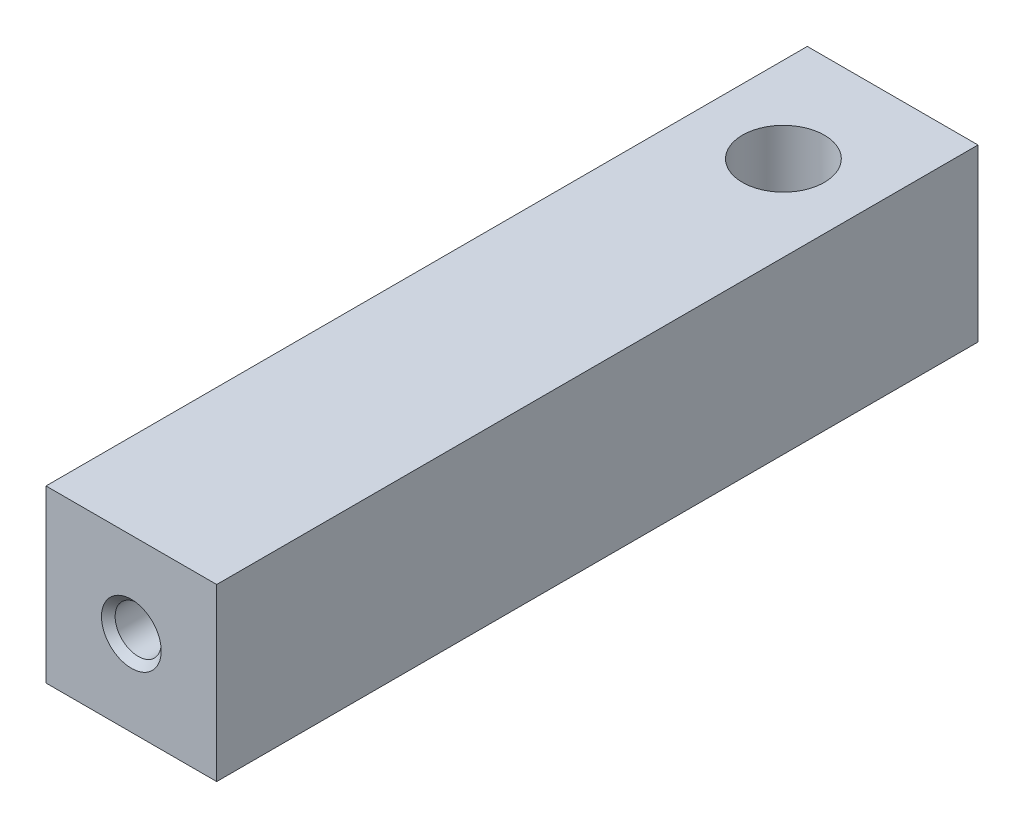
ISO-10303-21;
HEADER;
FILE_DESCRIPTION(('STEP AP214'),'2;1');
FILE_NAME('part.step','',(''),(''),'','','');
FILE_SCHEMA(('AUTOMOTIVE_DESIGN { 1 0 10303 214 1 1 1 1 }'));
ENDSEC;
DATA;
#1=APPLICATION_CONTEXT('core data for automotive mechanical design processes');
#2=APPLICATION_PROTOCOL_DEFINITION('international standard','automotive_design',2000,#1);
#3=PRODUCT_CONTEXT('',#1,'mechanical');
#4=PRODUCT('Part','Part','',(#3));
#5=PRODUCT_RELATED_PRODUCT_CATEGORY('part','',(#4));
#6=PRODUCT_DEFINITION_FORMATION('','',#4);
#7=PRODUCT_DEFINITION_CONTEXT('part definition',#1,'design');
#8=PRODUCT_DEFINITION('design','',#6,#7);
#9=PRODUCT_DEFINITION_SHAPE('','',#8);
#10=(LENGTH_UNIT() NAMED_UNIT(*) SI_UNIT(.MILLI.,.METRE.));
#11=(NAMED_UNIT(*) PLANE_ANGLE_UNIT() SI_UNIT($,.RADIAN.));
#12=(NAMED_UNIT(*) SI_UNIT($,.STERADIAN.) SOLID_ANGLE_UNIT());
#13=UNCERTAINTY_MEASURE_WITH_UNIT(LENGTH_MEASURE(1.E-05),#10,'distance_accuracy_value','');
#14=(GEOMETRIC_REPRESENTATION_CONTEXT(3) GLOBAL_UNCERTAINTY_ASSIGNED_CONTEXT((#13)) GLOBAL_UNIT_ASSIGNED_CONTEXT((#10,
#11,#12)) REPRESENTATION_CONTEXT('',''));
#15=CARTESIAN_POINT('',(0.,0.,0.));
#16=DIRECTION('',(0.,0.,1.));
#17=DIRECTION('',(1.,0.,0.));
#18=AXIS2_PLACEMENT_3D('',#15,#16,#17);
#19=CARTESIAN_POINT('',(-12.5,12.5000000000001,111.5));
#20=DIRECTION('',(1.,0.,0.));
#21=DIRECTION('',(0.,1.,0.));
#22=AXIS2_PLACEMENT_3D('',#19,#20,#21);
#23=PLANE('',#22);
#24=DIRECTION('',(0.,-1.,0.));
#25=VECTOR('',#24,1.);
#26=CARTESIAN_POINT('',(-12.5,12.4999999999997,0.));
#27=LINE('',#26,#25);
#28=CARTESIAN_POINT('',(-12.5,12.4999999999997,0.));
#29=VERTEX_POINT('',#28);
#30=CARTESIAN_POINT('',(-12.5,-12.5000000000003,0.));
#31=VERTEX_POINT('',#30);
#32=EDGE_CURVE('E123',#29,#31,#27,.T.);
#33=ORIENTED_EDGE('',*,*,#32,.T.);
#34=DIRECTION('',(0.,0.,-1.));
#35=VECTOR('',#34,1.);
#36=CARTESIAN_POINT('',(-12.5,-12.4999999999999,111.5));
#37=LINE('',#36,#35);
#38=CARTESIAN_POINT('',(-12.5,-12.4999999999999,111.5));
#39=VERTEX_POINT('',#38);
#40=EDGE_CURVE('E162',#39,#31,#37,.T.);
#41=ORIENTED_EDGE('',*,*,#40,.F.);
#42=DIRECTION('',(0.,-1.,0.));
#43=VECTOR('',#42,1.);
#44=CARTESIAN_POINT('',(-12.5,12.5000000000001,111.5));
#45=LINE('',#44,#43);
#46=CARTESIAN_POINT('',(-12.5,12.5000000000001,111.5));
#47=VERTEX_POINT('',#46);
#48=EDGE_CURVE('E137',#47,#39,#45,.T.);
#49=ORIENTED_EDGE('',*,*,#48,.F.);
#50=DIRECTION('',(0.,0.,-1.));
#51=VECTOR('',#50,1.);
#52=CARTESIAN_POINT('',(-12.5,12.5000000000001,111.5));
#53=LINE('',#52,#51);
#54=EDGE_CURVE('E146',#47,#29,#53,.T.);
#55=ORIENTED_EDGE('',*,*,#54,.T.);
#56=EDGE_LOOP('',(#33,#41,#49,#55));
#57=FACE_BOUND('',#56,.T.);
#58=ADVANCED_FACE('F58',(#57),#23,.F.);
#59=CARTESIAN_POINT('',(-12.5,-12.4999999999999,111.5));
#60=DIRECTION('',(0.,1.,0.));
#61=DIRECTION('',(0.,0.,1.));
#62=AXIS2_PLACEMENT_3D('',#59,#60,#61);
#63=PLANE('',#62);
#64=CARTESIAN_POINT('',(0.,-12.5,16.));
#65=DIRECTION('',(0.,1.,0.));
#66=DIRECTION('',(0.,0.,1.));
#67=AXIS2_PLACEMENT_3D('',#64,#65,#66);
#68=CIRCLE('',#67,6.);
#69=CARTESIAN_POINT('',(0.,-12.5,22.));
#70=VERTEX_POINT('',#69);
#71=EDGE_CURVE('E124',#70,#70,#68,.F.);
#72=ORIENTED_EDGE('',*,*,#71,.F.);
#73=EDGE_LOOP('',(#72));
#74=FACE_BOUND('',#73,.T.);
#75=DIRECTION('',(1.,0.,0.));
#76=VECTOR('',#75,1.);
#77=CARTESIAN_POINT('',(-12.5,-12.5000000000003,0.));
#78=LINE('',#77,#76);
#79=CARTESIAN_POINT('',(12.4999999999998,-12.5,0.));
#80=VERTEX_POINT('',#79);
#81=EDGE_CURVE('E130',#31,#80,#78,.T.);
#82=ORIENTED_EDGE('',*,*,#81,.T.);
#83=DIRECTION('',(0.,0.,-1.));
#84=VECTOR('',#83,1.);
#85=CARTESIAN_POINT('',(12.4999999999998,-12.5000000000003,111.5));
#86=LINE('',#85,#84);
#87=CARTESIAN_POINT('',(12.4999999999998,-12.5000000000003,111.5));
#88=VERTEX_POINT('',#87);
#89=EDGE_CURVE('E159',#88,#80,#86,.T.);
#90=ORIENTED_EDGE('',*,*,#89,.F.);
#91=DIRECTION('',(1.,0.,0.));
#92=VECTOR('',#91,1.);
#93=CARTESIAN_POINT('',(-12.5,-12.4999999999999,111.5));
#94=LINE('',#93,#92);
#95=EDGE_CURVE('E108',#39,#88,#94,.T.);
#96=ORIENTED_EDGE('',*,*,#95,.F.);
#97=ORIENTED_EDGE('',*,*,#40,.T.);
#98=EDGE_LOOP('',(#82,#90,#96,#97));
#99=FACE_BOUND('',#98,.T.);
#100=ADVANCED_FACE('F179',(#74,#99),#63,.F.);
#101=CARTESIAN_POINT('',(12.4999999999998,-12.5000000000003,111.5));
#102=DIRECTION('',(-1.,0.,0.));
#103=DIRECTION('',(0.,0.,1.));
#104=AXIS2_PLACEMENT_3D('',#101,#102,#103);
#105=PLANE('',#104);
#106=DIRECTION('',(0.,1.,0.));
#107=VECTOR('',#106,1.);
#108=CARTESIAN_POINT('',(12.4999999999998,-12.5,0.));
#109=LINE('',#108,#107);
#110=CARTESIAN_POINT('',(12.4999999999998,12.5,0.));
#111=VERTEX_POINT('',#110);
#112=EDGE_CURVE('E94',#80,#111,#109,.T.);
#113=ORIENTED_EDGE('',*,*,#112,.T.);
#114=DIRECTION('',(0.,0.,-1.));
#115=VECTOR('',#114,1.);
#116=CARTESIAN_POINT('',(12.4999999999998,12.4999999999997,111.5));
#117=LINE('',#116,#115);
#118=CARTESIAN_POINT('',(12.4999999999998,12.4999999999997,111.5));
#119=VERTEX_POINT('',#118);
#120=EDGE_CURVE('E156',#119,#111,#117,.T.);
#121=ORIENTED_EDGE('',*,*,#120,.F.);
#122=DIRECTION('',(0.,1.,0.));
#123=VECTOR('',#122,1.);
#124=CARTESIAN_POINT('',(12.4999999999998,-12.5000000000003,111.5));
#125=LINE('',#124,#123);
#126=EDGE_CURVE('E142',#88,#119,#125,.T.);
#127=ORIENTED_EDGE('',*,*,#126,.F.);
#128=ORIENTED_EDGE('',*,*,#89,.T.);
#129=EDGE_LOOP('',(#113,#121,#127,#128));
#130=FACE_BOUND('',#129,.T.);
#131=ADVANCED_FACE('F184',(#130),#105,.F.);
#132=CARTESIAN_POINT('',(12.4999999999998,12.4999999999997,111.5));
#133=DIRECTION('',(0.,-1.,0.));
#134=DIRECTION('',(1.,0.,0.));
#135=AXIS2_PLACEMENT_3D('',#132,#133,#134);
#136=PLANE('',#135);
#137=CARTESIAN_POINT('',(0.,12.5,15.9999999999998));
#138=DIRECTION('',(0.,1.,0.));
#139=DIRECTION('',(-1.,0.,0.));
#140=AXIS2_PLACEMENT_3D('',#137,#138,#139);
#141=CIRCLE('',#140,6.);
#142=CARTESIAN_POINT('',(-6.,12.5,15.9999999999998));
#143=VERTEX_POINT('',#142);
#144=EDGE_CURVE('E133',#143,#143,#141,.T.);
#145=ORIENTED_EDGE('',*,*,#144,.F.);
#146=EDGE_LOOP('',(#145));
#147=FACE_BOUND('',#146,.T.);
#148=DIRECTION('',(-1.,0.,0.));
#149=VECTOR('',#148,1.);
#150=CARTESIAN_POINT('',(12.4999999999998,12.5,0.));
#151=LINE('',#150,#149);
#152=EDGE_CURVE('E100',#111,#29,#151,.T.);
#153=ORIENTED_EDGE('',*,*,#152,.T.);
#154=ORIENTED_EDGE('',*,*,#54,.F.);
#155=DIRECTION('',(-1.,0.,0.));
#156=VECTOR('',#155,1.);
#157=CARTESIAN_POINT('',(12.4999999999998,12.4999999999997,111.5));
#158=LINE('',#157,#156);
#159=EDGE_CURVE('E76',#119,#47,#158,.T.);
#160=ORIENTED_EDGE('',*,*,#159,.F.);
#161=ORIENTED_EDGE('',*,*,#120,.T.);
#162=EDGE_LOOP('',(#153,#154,#160,#161));
#163=FACE_BOUND('',#162,.T.);
#164=ADVANCED_FACE('F190',(#147,#163),#136,.F.);
#165=CARTESIAN_POINT('',(-12.5,12.5000000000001,111.5));
#166=DIRECTION('',(0.,0.,-1.));
#167=DIRECTION('',(-1.,0.,0.));
#168=AXIS2_PLACEMENT_3D('',#165,#166,#167);
#169=PLANE('',#168);
#170=CARTESIAN_POINT('',(0.,1.38777878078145E-13,111.5));
#171=DIRECTION('',(0.,0.,-1.));
#172=DIRECTION('',(-1.,0.,0.));
#173=AXIS2_PLACEMENT_3D('',#170,#171,#172);
#174=CIRCLE('',#173,4.375);
#175=CARTESIAN_POINT('',(-4.375,1.38777878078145E-13,111.5));
#176=VERTEX_POINT('',#175);
#177=EDGE_CURVE('E13',#176,#176,#174,.T.);
#178=ORIENTED_EDGE('',*,*,#177,.T.);
#179=EDGE_LOOP('',(#178));
#180=FACE_BOUND('',#179,.T.);
#181=ORIENTED_EDGE('',*,*,#48,.T.);
#182=ORIENTED_EDGE('',*,*,#95,.T.);
#183=ORIENTED_EDGE('',*,*,#126,.T.);
#184=ORIENTED_EDGE('',*,*,#159,.T.);
#185=EDGE_LOOP('',(#181,#182,#183,#184));
#186=FACE_BOUND('',#185,.T.);
#187=ADVANCED_FACE('F193',(#180,#186),#169,.F.);
#188=CARTESIAN_POINT('',(-12.5,12.4999999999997,0.));
#189=DIRECTION('',(0.,0.,-1.));
#190=DIRECTION('',(-1.,0.,0.));
#191=AXIS2_PLACEMENT_3D('',#188,#189,#190);
#192=PLANE('',#191);
#193=ORIENTED_EDGE('',*,*,#32,.F.);
#194=ORIENTED_EDGE('',*,*,#152,.F.);
#195=ORIENTED_EDGE('',*,*,#112,.F.);
#196=ORIENTED_EDGE('',*,*,#81,.F.);
#197=EDGE_LOOP('',(#193,#194,#195,#196));
#198=FACE_BOUND('',#197,.T.);
#199=ADVANCED_FACE('F195',(#198),#192,.T.);
#200=CARTESIAN_POINT('',(0.,1.38777878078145E-13,111.5));
#201=DIRECTION('',(0.,0.,1.));
#202=DIRECTION('',(1.,0.,0.));
#203=AXIS2_PLACEMENT_3D('',#200,#201,#202);
#204=CYLINDRICAL_SURFACE('',#203,3.375);
#205=CARTESIAN_POINT('',(-3.33066907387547E-13,1.38777878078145E-13,110.5));
#206=DIRECTION('',(0.,0.,-1.));
#207=DIRECTION('',(-1.,0.,0.));
#208=AXIS2_PLACEMENT_3D('',#205,#206,#207);
#209=CIRCLE('',#208,3.375);
#210=CARTESIAN_POINT('',(-3.37500000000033,1.38777878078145E-13,110.5));
#211=VERTEX_POINT('',#210);
#212=EDGE_CURVE('E68',#211,#211,#209,.F.);
#213=ORIENTED_EDGE('',*,*,#212,.T.);
#214=EDGE_LOOP('',(#213));
#215=FACE_BOUND('',#214,.T.);
#216=CARTESIAN_POINT('',(-3.33066907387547E-13,1.38777878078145E-13,89.7500000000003));
#217=DIRECTION('',(0.,0.,1.));
#218=DIRECTION('',(1.,0.,0.));
#219=AXIS2_PLACEMENT_3D('',#216,#217,#218);
#220=CIRCLE('',#219,3.37499999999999);
#221=CARTESIAN_POINT('',(3.37499999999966,1.38777878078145E-13,89.7500000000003));
#222=VERTEX_POINT('',#221);
#223=EDGE_CURVE('E120',#222,#222,#220,.T.);
#224=ORIENTED_EDGE('',*,*,#223,.F.);
#225=EDGE_LOOP('',(#224));
#226=FACE_BOUND('',#225,.T.);
#227=ADVANCED_FACE('F116',(#215,#226),#204,.F.);
#228=CARTESIAN_POINT('',(-3.33066907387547E-13,1.38777878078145E-13,89.7500000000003));
#229=DIRECTION('',(0.,0.,1.));
#230=DIRECTION('',(1.,0.,0.));
#231=AXIS2_PLACEMENT_3D('',#228,#229,#230);
#232=CONICAL_SURFACE('',#231,3.37499999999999,1.02974425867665);
#233=CARTESIAN_POINT('',(0.,1.38777878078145E-13,87.7220954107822));
#234=VERTEX_POINT('',#233);
#235=VERTEX_LOOP('',#234);
#236=FACE_BOUND('',#235,.T.);
#237=ORIENTED_EDGE('',*,*,#223,.T.);
#238=EDGE_LOOP('',(#237));
#239=FACE_BOUND('',#238,.T.);
#240=ADVANCED_FACE('F112',(#236,#239),#232,.F.);
#241=CARTESIAN_POINT('',(0.,-12.501,16.));
#242=DIRECTION('',(0.,1.,0.));
#243=DIRECTION('',(-1.,0.,0.));
#244=AXIS2_PLACEMENT_3D('',#241,#242,#243);
#245=CYLINDRICAL_SURFACE('',#244,6.);
#246=ORIENTED_EDGE('',*,*,#144,.T.);
#247=EDGE_LOOP('',(#246));
#248=FACE_BOUND('',#247,.T.);
#249=ORIENTED_EDGE('',*,*,#71,.T.);
#250=EDGE_LOOP('',(#249));
#251=FACE_BOUND('',#250,.T.);
#252=ADVANCED_FACE('F115',(#248,#251),#245,.F.);
#253=CARTESIAN_POINT('',(-3.33066907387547E-13,1.38777878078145E-13,110.5));
#254=DIRECTION('',(0.,0.,1.));
#255=DIRECTION('',(1.,0.,0.));
#256=AXIS2_PLACEMENT_3D('',#253,#254,#255);
#257=CONICAL_SURFACE('',#256,3.375,0.785398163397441);
#258=ORIENTED_EDGE('',*,*,#177,.F.);
#259=EDGE_LOOP('',(#258));
#260=FACE_BOUND('',#259,.T.);
#261=ORIENTED_EDGE('',*,*,#212,.F.);
#262=EDGE_LOOP('',(#261));
#263=FACE_BOUND('',#262,.T.);
#264=ADVANCED_FACE('F60',(#260,#263),#257,.F.);
#265=CLOSED_SHELL('',(#58,#100,#131,#164,#187,#199,#227,#240,#252,#264));
#266=MANIFOLD_SOLID_BREP('B2',#265);
#267=ADVANCED_BREP_SHAPE_REPRESENTATION('',(#18,#266),#14);
#268=SHAPE_DEFINITION_REPRESENTATION(#9,#267);
ENDSEC;
END-ISO-10303-21;
